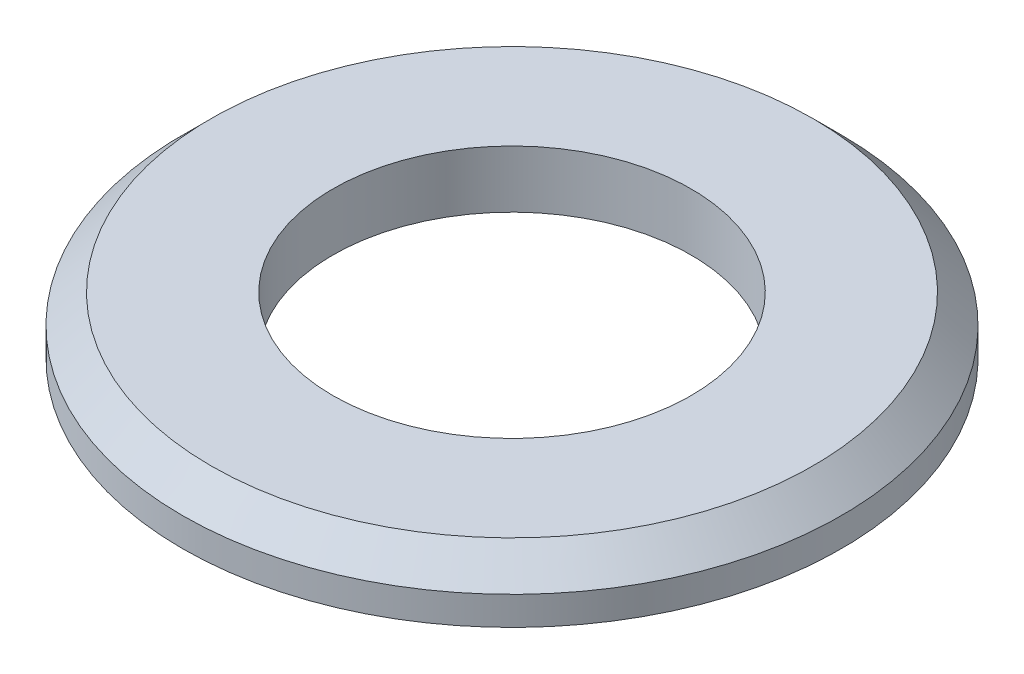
ISO-10303-21;
HEADER;
FILE_DESCRIPTION(('STEP AP214'),'2;1');
FILE_NAME('part.step','',(''),(''),'','','');
FILE_SCHEMA(('AUTOMOTIVE_DESIGN { 1 0 10303 214 1 1 1 1 }'));
ENDSEC;
DATA;
#1=APPLICATION_CONTEXT('core data for automotive mechanical design processes');
#2=APPLICATION_PROTOCOL_DEFINITION('international standard','automotive_design',2000,#1);
#3=PRODUCT_CONTEXT('',#1,'mechanical');
#4=PRODUCT('Part','Part','',(#3));
#5=PRODUCT_RELATED_PRODUCT_CATEGORY('part','',(#4));
#6=PRODUCT_DEFINITION_FORMATION('','',#4);
#7=PRODUCT_DEFINITION_CONTEXT('part definition',#1,'design');
#8=PRODUCT_DEFINITION('design','',#6,#7);
#9=PRODUCT_DEFINITION_SHAPE('','',#8);
#10=(LENGTH_UNIT() NAMED_UNIT(*) SI_UNIT(.MILLI.,.METRE.));
#11=(NAMED_UNIT(*) PLANE_ANGLE_UNIT() SI_UNIT($,.RADIAN.));
#12=(NAMED_UNIT(*) SI_UNIT($,.STERADIAN.) SOLID_ANGLE_UNIT());
#13=UNCERTAINTY_MEASURE_WITH_UNIT(LENGTH_MEASURE(1.E-05),#10,'distance_accuracy_value','');
#14=(GEOMETRIC_REPRESENTATION_CONTEXT(3) GLOBAL_UNCERTAINTY_ASSIGNED_CONTEXT((#13)) GLOBAL_UNIT_ASSIGNED_CONTEXT((#10,
#11,#12)) REPRESENTATION_CONTEXT('',''));
#15=CARTESIAN_POINT('',(0.,0.,0.));
#16=DIRECTION('',(0.,0.,1.));
#17=DIRECTION('',(1.,0.,0.));
#18=AXIS2_PLACEMENT_3D('',#15,#16,#17);
#19=CARTESIAN_POINT('',(0.,8.,0.));
#20=DIRECTION('',(0.,1.,0.));
#21=DIRECTION('',(0.,0.,1.));
#22=AXIS2_PLACEMENT_3D('',#19,#20,#21);
#23=PLANE('',#22);
#24=CARTESIAN_POINT('',(0.,8.,0.));
#25=DIRECTION('',(0.,1.,0.));
#26=DIRECTION('',(0.,0.,1.));
#27=AXIS2_PLACEMENT_3D('',#24,#25,#26);
#28=CIRCLE('',#27,42.);
#29=CARTESIAN_POINT('',(0.,8.,42.));
#30=VERTEX_POINT('',#29);
#31=EDGE_CURVE('E35',#30,#30,#28,.T.);
#32=ORIENTED_EDGE('',*,*,#31,.T.);
#33=EDGE_LOOP('',(#32));
#34=FACE_BOUND('',#33,.T.);
#35=CARTESIAN_POINT('',(0.,8.,0.));
#36=DIRECTION('',(0.,1.,0.));
#37=DIRECTION('',(0.,0.,1.));
#38=AXIS2_PLACEMENT_3D('',#35,#36,#37);
#39=CIRCLE('',#38,25.);
#40=CARTESIAN_POINT('',(0.,8.,25.));
#41=VERTEX_POINT('',#40);
#42=EDGE_CURVE('E43',#41,#41,#39,.T.);
#43=ORIENTED_EDGE('',*,*,#42,.F.);
#44=EDGE_LOOP('',(#43));
#45=FACE_BOUND('',#44,.T.);
#46=ADVANCED_FACE('F28',(#34,#45),#23,.T.);
#47=CARTESIAN_POINT('',(0.,0.,0.));
#48=DIRECTION('',(0.,1.,0.));
#49=DIRECTION('',(0.,0.,1.));
#50=AXIS2_PLACEMENT_3D('',#47,#48,#49);
#51=PLANE('',#50);
#52=CARTESIAN_POINT('',(0.,0.,0.));
#53=DIRECTION('',(0.,1.,0.));
#54=DIRECTION('',(0.,0.,1.));
#55=AXIS2_PLACEMENT_3D('',#52,#53,#54);
#56=CIRCLE('',#55,46.);
#57=CARTESIAN_POINT('',(0.,0.,46.));
#58=VERTEX_POINT('',#57);
#59=EDGE_CURVE('E39',#58,#58,#56,.T.);
#60=ORIENTED_EDGE('',*,*,#59,.F.);
#61=EDGE_LOOP('',(#60));
#62=FACE_BOUND('',#61,.T.);
#63=CARTESIAN_POINT('',(0.,0.,0.));
#64=DIRECTION('',(0.,1.,0.));
#65=DIRECTION('',(0.,0.,1.));
#66=AXIS2_PLACEMENT_3D('',#63,#64,#65);
#67=CIRCLE('',#66,25.);
#68=CARTESIAN_POINT('',(0.,0.,25.));
#69=VERTEX_POINT('',#68);
#70=EDGE_CURVE('E48',#69,#69,#67,.T.);
#71=ORIENTED_EDGE('',*,*,#70,.T.);
#72=EDGE_LOOP('',(#71));
#73=FACE_BOUND('',#72,.T.);
#74=ADVANCED_FACE('F52',(#62,#73),#51,.F.);
#75=CARTESIAN_POINT('',(0.,8.,0.));
#76=DIRECTION('',(0.,-1.,0.));
#77=DIRECTION('',(0.,0.,-1.));
#78=AXIS2_PLACEMENT_3D('',#75,#76,#77);
#79=CYLINDRICAL_SURFACE('',#78,46.);
#80=CARTESIAN_POINT('',(0.,3.99999999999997,0.));
#81=DIRECTION('',(0.,1.,0.));
#82=DIRECTION('',(0.,0.,1.));
#83=AXIS2_PLACEMENT_3D('',#80,#81,#82);
#84=CIRCLE('',#83,46.);
#85=CARTESIAN_POINT('',(0.,3.99999999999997,46.));
#86=VERTEX_POINT('',#85);
#87=EDGE_CURVE('E10',#86,#86,#84,.F.);
#88=ORIENTED_EDGE('',*,*,#87,.T.);
#89=EDGE_LOOP('',(#88));
#90=FACE_BOUND('',#89,.T.);
#91=ORIENTED_EDGE('',*,*,#59,.T.);
#92=EDGE_LOOP('',(#91));
#93=FACE_BOUND('',#92,.T.);
#94=ADVANCED_FACE('F30',(#90,#93),#79,.T.);
#95=CARTESIAN_POINT('',(0.,8.,0.));
#96=DIRECTION('',(0.,-1.,0.));
#97=DIRECTION('',(0.,0.,-1.));
#98=AXIS2_PLACEMENT_3D('',#95,#96,#97);
#99=CYLINDRICAL_SURFACE('',#98,25.);
#100=ORIENTED_EDGE('',*,*,#42,.T.);
#101=EDGE_LOOP('',(#100));
#102=FACE_BOUND('',#101,.T.);
#103=ORIENTED_EDGE('',*,*,#70,.F.);
#104=EDGE_LOOP('',(#103));
#105=FACE_BOUND('',#104,.T.);
#106=ADVANCED_FACE('F54',(#102,#105),#99,.F.);
#107=CARTESIAN_POINT('',(0.,8.,0.));
#108=DIRECTION('',(0.,-1.,0.));
#109=DIRECTION('',(0.,0.,-1.));
#110=AXIS2_PLACEMENT_3D('',#107,#108,#109);
#111=CONICAL_SURFACE('',#110,42.,0.785398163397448);
#112=ORIENTED_EDGE('',*,*,#87,.F.);
#113=EDGE_LOOP('',(#112));
#114=FACE_BOUND('',#113,.T.);
#115=ORIENTED_EDGE('',*,*,#31,.F.);
#116=EDGE_LOOP('',(#115));
#117=FACE_BOUND('',#116,.T.);
#118=ADVANCED_FACE('F56',(#114,#117),#111,.T.);
#119=CLOSED_SHELL('',(#46,#74,#94,#106,#118));
#120=MANIFOLD_SOLID_BREP('B2',#119);
#121=ADVANCED_BREP_SHAPE_REPRESENTATION('',(#18,#120),#14);
#122=SHAPE_DEFINITION_REPRESENTATION(#9,#121);
ENDSEC;
END-ISO-10303-21;
